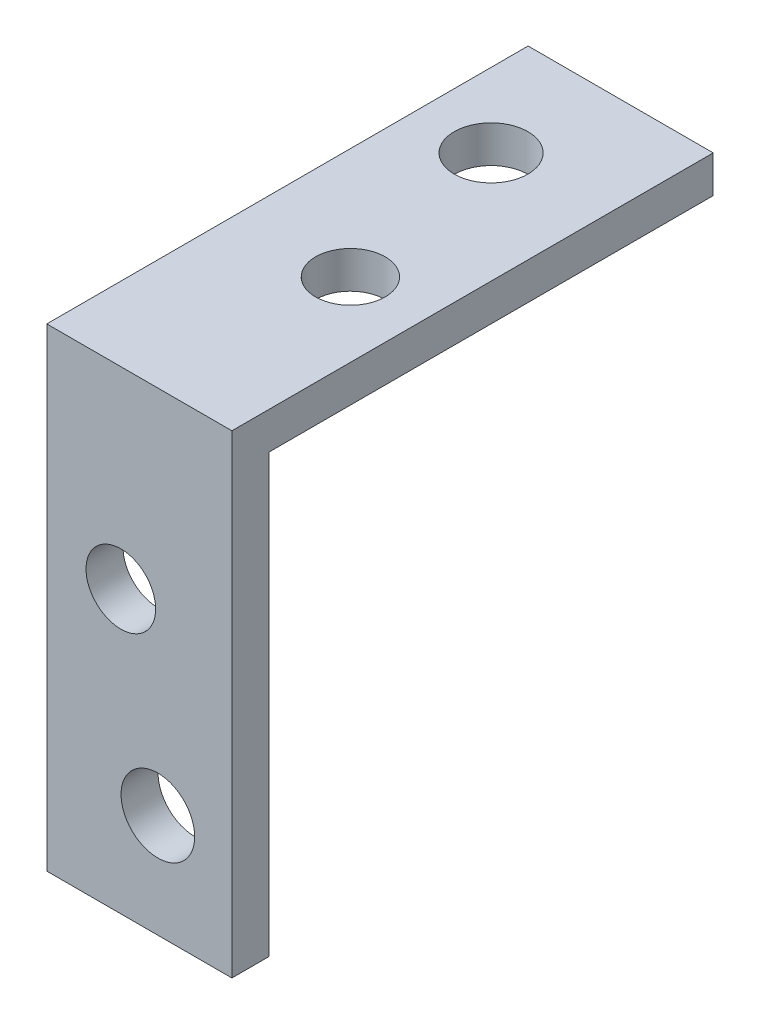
from build123d import *

# Parameters (mm, degrees)
SKETCH1_W      = 15.875
SKETCH1_H      = 41.275
SKETCH1_R      = 2.9845
SKETCH1_R_2    = 3.157789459
EXTRUDE1_DEPTH = 3.175
SKETCH3_W      = 15.875
SKETCH3_H      = 40.64
SKETCH3_R      = 2.9845
SKETCH3_R_2    = 3.157789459
EXTRUDE2_DEPTH = 3.175


with BuildPart() as part:
    # Sketch1 → Extrude1 (new body)
    with BuildSketch(Plane(origin=(0, 0, 0), x_dir=(1, 0, 0), z_dir=(0, 1, 0))):
        with Locations((7.9375, 20.6375)):
            Rectangle(SKETCH1_W, SKETCH1_H)
        with Locations(Location((9.525, 16.51, 0), (0, 0, 270))):
            Circle(SKETCH1_R, mode=Mode.SUBTRACT)
        with Locations(Location((6.35, 31.75, 0), (0, 0, 270))):
            Circle(SKETCH1_R_2, mode=Mode.SUBTRACT)
    extrude(amount=EXTRUDE1_DEPTH)

    # Sketch3 → Extrude2 (add)
    with BuildSketch(Plane.XY):
        with Locations((7.9375, -17.145)):
            Rectangle(SKETCH3_W, SKETCH3_H)
        with Locations((6.35, -13.335)):
            Circle(SKETCH3_R, mode=Mode.SUBTRACT)
        with Locations((9.525, -28.575)):
            Circle(SKETCH3_R_2, mode=Mode.SUBTRACT)
    extrude(amount=-EXTRUDE2_DEPTH)


solid = part.part
